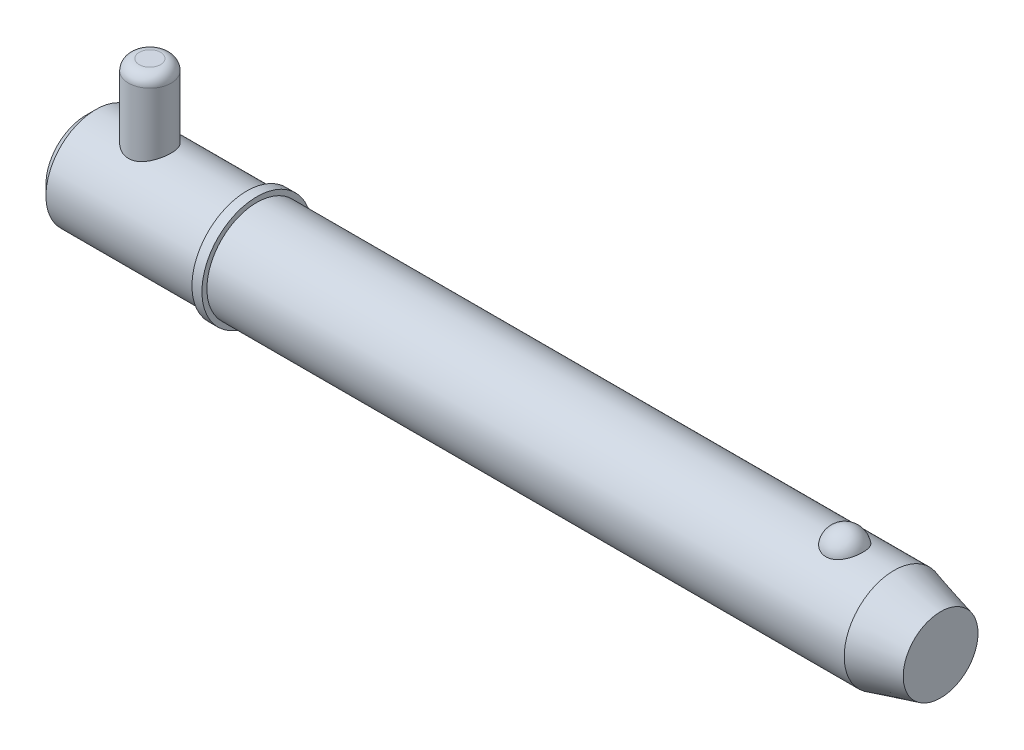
ISO-10303-21;
HEADER;
FILE_DESCRIPTION(('STEP AP214'),'2;1');
FILE_NAME('part.step','',(''),(''),'','','');
FILE_SCHEMA(('AUTOMOTIVE_DESIGN { 1 0 10303 214 1 1 1 1 }'));
ENDSEC;
DATA;
#1=APPLICATION_CONTEXT('core data for automotive mechanical design processes');
#2=APPLICATION_PROTOCOL_DEFINITION('international standard','automotive_design',2000,#1);
#3=PRODUCT_CONTEXT('',#1,'mechanical');
#4=PRODUCT('Part','Part','',(#3));
#5=PRODUCT_RELATED_PRODUCT_CATEGORY('part','',(#4));
#6=PRODUCT_DEFINITION_FORMATION('','',#4);
#7=PRODUCT_DEFINITION_CONTEXT('part definition',#1,'design');
#8=PRODUCT_DEFINITION('design','',#6,#7);
#9=PRODUCT_DEFINITION_SHAPE('','',#8);
#10=(LENGTH_UNIT() NAMED_UNIT(*) SI_UNIT(.MILLI.,.METRE.));
#11=(NAMED_UNIT(*) PLANE_ANGLE_UNIT() SI_UNIT($,.RADIAN.));
#12=(NAMED_UNIT(*) SI_UNIT($,.STERADIAN.) SOLID_ANGLE_UNIT());
#13=UNCERTAINTY_MEASURE_WITH_UNIT(LENGTH_MEASURE(1.E-05),#10,'distance_accuracy_value','');
#14=(GEOMETRIC_REPRESENTATION_CONTEXT(3) GLOBAL_UNCERTAINTY_ASSIGNED_CONTEXT((#13)) GLOBAL_UNIT_ASSIGNED_CONTEXT((#10,
#11,#12)) REPRESENTATION_CONTEXT('',''));
#15=CARTESIAN_POINT('',(0.,0.,0.));
#16=DIRECTION('',(0.,0.,1.));
#17=DIRECTION('',(1.,0.,0.));
#18=AXIS2_PLACEMENT_3D('',#15,#16,#17);
#19=CARTESIAN_POINT('',(14.28,26.985,0.));
#20=DIRECTION('',(0.,-1.,0.));
#21=DIRECTION('',(0.,0.,-1.));
#22=AXIS2_PLACEMENT_3D('',#19,#20,#21);
#23=CYLINDRICAL_SURFACE('',#22,4.76);
#24=CARTESIAN_POINT('',(14.28,-8.73500000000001,0.));
#25=DIRECTION('',(0.,1.,0.));
#26=DIRECTION('',(0.,0.,1.));
#27=AXIS2_PLACEMENT_3D('',#24,#25,#26);
#28=CIRCLE('',#27,4.76);
#29=CARTESIAN_POINT('',(14.28,-8.73500000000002,-4.76));
#30=VERTEX_POINT('',#29);
#31=EDGE_CURVE('P0_E25',#30,#30,#28,.T.);
#32=CARTESIAN_POINT('',(14.28,24.605,0.));
#33=DIRECTION('',(0.,1.,0.));
#34=DIRECTION('',(0.,0.,1.));
#35=AXIS2_PLACEMENT_3D('',#32,#33,#34);
#36=CIRCLE('',#35,4.76);
#37=CARTESIAN_POINT('',(14.28,24.605,-4.76));
#38=VERTEX_POINT('',#37);
#39=EDGE_CURVE('P0_E29',#38,#38,#36,.F.);
#40=CARTESIAN_POINT('',(14.28,-8.73500000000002,-4.76));
#41=CARTESIAN_POINT('',(14.28,-8.38770833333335,-4.76));
#42=CARTESIAN_POINT('',(14.28,-8.04041666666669,-4.76));
#43=CARTESIAN_POINT('',(14.28,-7.34583333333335,-4.76));
#44=CARTESIAN_POINT('',(14.28,-6.99854166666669,-4.76));
#45=CARTESIAN_POINT('',(14.28,-6.30395833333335,-4.76));
#46=CARTESIAN_POINT('',(14.28,-5.95666666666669,-4.76));
#47=CARTESIAN_POINT('',(14.28,-5.26208333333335,-4.76));
#48=CARTESIAN_POINT('',(14.28,-4.91479166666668,-4.76));
#49=CARTESIAN_POINT('',(14.28,-4.22020833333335,-4.76));
#50=CARTESIAN_POINT('',(14.28,-3.87291666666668,-4.76));
#51=CARTESIAN_POINT('',(14.28,-3.17833333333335,-4.76));
#52=CARTESIAN_POINT('',(14.28,-2.83104166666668,-4.76));
#53=CARTESIAN_POINT('',(14.28,-2.13645833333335,-4.76));
#54=CARTESIAN_POINT('',(14.28,-1.78916666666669,-4.76));
#55=CARTESIAN_POINT('',(14.28,-1.09458333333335,-4.76));
#56=CARTESIAN_POINT('',(14.28,-0.747291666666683,-4.76));
#57=CARTESIAN_POINT('',(14.28,-0.052708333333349,-4.76));
#58=CARTESIAN_POINT('',(14.28,0.294583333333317,-4.76));
#59=CARTESIAN_POINT('',(14.28,0.989166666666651,-4.76));
#60=CARTESIAN_POINT('',(14.28,1.33645833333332,-4.76));
#61=CARTESIAN_POINT('',(14.28,2.03104166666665,-4.76));
#62=CARTESIAN_POINT('',(14.28,2.37833333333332,-4.76));
#63=CARTESIAN_POINT('',(14.28,3.07291666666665,-4.76));
#64=CARTESIAN_POINT('',(14.28,3.42020833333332,-4.76));
#65=CARTESIAN_POINT('',(14.28,4.11479166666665,-4.76));
#66=CARTESIAN_POINT('',(14.28,4.46208333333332,-4.76));
#67=CARTESIAN_POINT('',(14.28,5.15666666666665,-4.76));
#68=CARTESIAN_POINT('',(14.28,5.50395833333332,-4.76));
#69=CARTESIAN_POINT('',(14.28,6.19854166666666,-4.76));
#70=CARTESIAN_POINT('',(14.28,6.54583333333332,-4.76));
#71=CARTESIAN_POINT('',(14.28,7.24041666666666,-4.76));
#72=CARTESIAN_POINT('',(14.28,7.58770833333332,-4.76));
#73=CARTESIAN_POINT('',(14.28,8.28229166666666,-4.76));
#74=CARTESIAN_POINT('',(14.28,8.62958333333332,-4.76));
#75=CARTESIAN_POINT('',(14.28,9.32416666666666,-4.76));
#76=CARTESIAN_POINT('',(14.28,9.67145833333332,-4.76));
#77=CARTESIAN_POINT('',(14.28,10.3660416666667,-4.76));
#78=CARTESIAN_POINT('',(14.28,10.7133333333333,-4.76));
#79=CARTESIAN_POINT('',(14.28,11.4079166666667,-4.76));
#80=CARTESIAN_POINT('',(14.28,11.7552083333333,-4.76));
#81=CARTESIAN_POINT('',(14.28,12.4497916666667,-4.76));
#82=CARTESIAN_POINT('',(14.28,12.7970833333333,-4.76));
#83=CARTESIAN_POINT('',(14.28,13.4916666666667,-4.76));
#84=CARTESIAN_POINT('',(14.28,13.8389583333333,-4.76));
#85=CARTESIAN_POINT('',(14.28,14.5335416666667,-4.76));
#86=CARTESIAN_POINT('',(14.28,14.8808333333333,-4.76));
#87=CARTESIAN_POINT('',(14.28,15.5754166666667,-4.76));
#88=CARTESIAN_POINT('',(14.28,15.9227083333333,-4.76));
#89=CARTESIAN_POINT('',(14.28,16.6172916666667,-4.76));
#90=CARTESIAN_POINT('',(14.28,16.9645833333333,-4.76));
#91=CARTESIAN_POINT('',(14.28,17.6591666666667,-4.76));
#92=CARTESIAN_POINT('',(14.28,18.0064583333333,-4.76));
#93=CARTESIAN_POINT('',(14.28,18.7010416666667,-4.76));
#94=CARTESIAN_POINT('',(14.28,19.0483333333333,-4.76));
#95=CARTESIAN_POINT('',(14.28,19.7429166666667,-4.76));
#96=CARTESIAN_POINT('',(14.28,20.0902083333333,-4.76));
#97=CARTESIAN_POINT('',(14.28,20.7847916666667,-4.76));
#98=CARTESIAN_POINT('',(14.28,21.1320833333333,-4.76));
#99=CARTESIAN_POINT('',(14.28,21.8266666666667,-4.76));
#100=CARTESIAN_POINT('',(14.28,22.1739583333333,-4.76));
#101=CARTESIAN_POINT('',(14.28,22.8685416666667,-4.76));
#102=CARTESIAN_POINT('',(14.28,23.2158333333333,-4.76));
#103=CARTESIAN_POINT('',(14.28,23.9104166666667,-4.76));
#104=CARTESIAN_POINT('',(14.28,24.2577083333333,-4.76));
#105=CARTESIAN_POINT('',(14.28,24.605,-4.76));
#106=B_SPLINE_CURVE_WITH_KNOTS('',3,(#40,#41,#42,#43,#44,#45,#46,#47,#48,#49,#50,#51,#52,#53,
#54,#55,#56,#57,#58,#59,#60,#61,#62,#63,#64,#65,#66,#67,#68,#69,#70,#71,#72,#73,#74,#75,#76,#77,
#78,#79,#80,#81,#82,#83,#84,#85,#86,#87,#88,#89,#90,#91,#92,#93,#94,#95,#96,#97,#98,#99,#100,
#101,#102,#103,#104,#105),.UNSPECIFIED.,.F.,.F.,(4,2,2,2,2,2,2,2,2,2,2,2,2,2,2,2,2,2,2,2,2,2,2,
2,2,2,2,2,2,2,2,2,4),(0.,1.041875,2.08375,3.125625,4.1675,5.209375,6.25125,7.293125,
8.33500000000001,9.376875,10.41875,11.460625,12.5025,13.544375,14.58625,15.628125,16.67,
17.711875,18.75375,19.795625,20.8375,21.879375,22.92125,23.963125,25.005,26.046875,27.08875,
28.130625,29.1725,30.214375,31.25625,32.298125,33.34),.UNSPECIFIED.);
#107=EDGE_CURVE('P0_BSEAM14',#30,#38,#106,.T.);
#108=ORIENTED_EDGE('',*,*,#31,.T.);
#109=ORIENTED_EDGE('',*,*,#39,.T.);
#110=ORIENTED_EDGE('',*,*,#107,.T.);
#111=ORIENTED_EDGE('',*,*,#107,.F.);
#112=EDGE_LOOP('',(#108,#110,#109,#111));
#113=FACE_BOUND('',#112,.T.);
#114=ADVANCED_FACE('P0_F14',(#113),#23,.T.);
#115=CARTESIAN_POINT('',(14.28,26.985,0.));
#116=DIRECTION('',(0.,1.,0.));
#117=DIRECTION('',(0.,0.,1.));
#118=AXIS2_PLACEMENT_3D('',#115,#116,#117);
#119=PLANE('',#118);
#120=CARTESIAN_POINT('',(14.28,26.985,0.));
#121=DIRECTION('',(0.,1.,0.));
#122=DIRECTION('',(0.,0.,1.));
#123=AXIS2_PLACEMENT_3D('',#120,#121,#122);
#124=CIRCLE('',#123,2.38);
#125=CARTESIAN_POINT('',(14.28,26.985,2.38));
#126=VERTEX_POINT('',#125);
#127=EDGE_CURVE('P0_E10',#126,#126,#124,.T.);
#128=ORIENTED_EDGE('',*,*,#127,.T.);
#129=EDGE_LOOP('',(#128));
#130=FACE_BOUND('',#129,.T.);
#131=ADVANCED_FACE('P0_F46',(#130),#119,.T.);
#132=CARTESIAN_POINT('',(14.28,-11.115,0.));
#133=DIRECTION('',(0.,1.,0.));
#134=DIRECTION('',(0.,0.,1.));
#135=AXIS2_PLACEMENT_3D('',#132,#133,#134);
#136=PLANE('',#135);
#137=CARTESIAN_POINT('',(14.28,-11.115,0.));
#138=DIRECTION('',(0.,1.,0.));
#139=DIRECTION('',(0.,0.,1.));
#140=AXIS2_PLACEMENT_3D('',#137,#138,#139);
#141=CIRCLE('',#140,2.38);
#142=CARTESIAN_POINT('',(14.28,-11.115,2.38));
#143=VERTEX_POINT('',#142);
#144=EDGE_CURVE('P0_E21',#143,#143,#141,.F.);
#145=ORIENTED_EDGE('',*,*,#144,.T.);
#146=EDGE_LOOP('',(#145));
#147=FACE_BOUND('',#146,.T.);
#148=ADVANCED_FACE('P0_F43',(#147),#136,.F.);
#149=CARTESIAN_POINT('',(14.28,-8.735,0.));
#150=DIRECTION('',(0.,1.,0.));
#151=DIRECTION('',(0.,0.,1.));
#152=AXIS2_PLACEMENT_3D('',#149,#150,#151);
#153=DEGENERATE_TOROIDAL_SURFACE('',#152,2.38,2.38,.T.);
#154=ORIENTED_EDGE('',*,*,#144,.F.);
#155=EDGE_LOOP('',(#154));
#156=FACE_BOUND('',#155,.T.);
#157=ORIENTED_EDGE('',*,*,#31,.F.);
#158=EDGE_LOOP('',(#157));
#159=FACE_BOUND('',#158,.T.);
#160=ADVANCED_FACE('P0_F38',(#156,#159),#153,.T.);
#161=CARTESIAN_POINT('',(14.28,24.605,0.));
#162=DIRECTION('',(0.,1.,0.));
#163=DIRECTION('',(0.,0.,1.));
#164=AXIS2_PLACEMENT_3D('',#161,#162,#163);
#165=DEGENERATE_TOROIDAL_SURFACE('',#164,2.38,2.38,.T.);
#166=ORIENTED_EDGE('',*,*,#39,.F.);
#167=EDGE_LOOP('',(#166));
#168=FACE_BOUND('',#167,.T.);
#169=ORIENTED_EDGE('',*,*,#127,.F.);
#170=EDGE_LOOP('',(#169));
#171=FACE_BOUND('',#170,.T.);
#172=ADVANCED_FACE('P0_F16',(#168,#171),#165,.T.);
#173=CLOSED_SHELL('',(#114,#131,#148,#160,#172));
#174=MANIFOLD_SOLID_BREP('P0_B1',#173);
#175=CARTESIAN_POINT('',(0.,0.,0.));
#176=DIRECTION('',(1.,0.,0.));
#177=DIRECTION('',(0.,0.,-1.));
#178=AXIS2_PLACEMENT_3D('',#175,#176,#177);
#179=CYLINDRICAL_SURFACE('',#178,11.115);
#180=CARTESIAN_POINT('',(180.129563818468,0.,0.));
#181=DIRECTION('',(1.,0.,0.));
#182=DIRECTION('',(0.,0.,-1.));
#183=AXIS2_PLACEMENT_3D('',#180,#181,#182);
#184=CIRCLE('',#183,11.115);
#185=CARTESIAN_POINT('',(180.129563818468,0.,-11.115));
#186=VERTEX_POINT('',#185);
#187=EDGE_CURVE('P1_E81',#186,#186,#184,.T.);
#188=ORIENTED_EDGE('',*,*,#187,.F.);
#189=EDGE_LOOP('',(#188));
#190=FACE_BOUND('',#189,.T.);
#191=CARTESIAN_POINT('',(38.1,0.,0.));
#192=DIRECTION('',(1.,0.,0.));
#193=DIRECTION('',(0.,0.,-1.));
#194=AXIS2_PLACEMENT_3D('',#191,#192,#193);
#195=CIRCLE('',#194,11.115);
#196=CARTESIAN_POINT('',(38.1,0.,-11.115));
#197=VERTEX_POINT('',#196);
#198=EDGE_CURVE('P1_E85',#197,#197,#195,.T.);
#199=ORIENTED_EDGE('',*,*,#198,.T.);
#200=EDGE_LOOP('',(#199));
#201=FACE_BOUND('',#200,.T.);
#202=CARTESIAN_POINT('',(169.131068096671,10.3028087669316,4.17077409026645));
#203=CARTESIAN_POINT('',(168.914775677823,10.3028003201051,4.17078240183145));
#204=CARTESIAN_POINT('',(168.698548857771,10.3098895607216,4.15340593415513));
#205=CARTESIAN_POINT('',(168.272540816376,10.3373834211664,4.08449540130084));
#206=CARTESIAN_POINT('',(168.062757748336,10.3577841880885,4.03297121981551));
#207=CARTESIAN_POINT('',(167.655782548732,10.4095237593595,3.89746513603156));
#208=CARTESIAN_POINT('',(167.458572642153,10.4408466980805,3.81353029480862));
#209=CARTESIAN_POINT('',(167.081338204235,10.5110236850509,3.61560339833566));
#210=CARTESIAN_POINT('',(166.901317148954,10.5498792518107,3.50160528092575));
#211=CARTESIAN_POINT('',(166.557684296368,10.6322884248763,3.24292464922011));
#212=CARTESIAN_POINT('',(166.394686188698,10.6759443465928,3.09746040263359));
#213=CARTESIAN_POINT('',(166.094591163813,10.7625291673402,2.7817192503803));
#214=CARTESIAN_POINT('',(165.957499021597,10.8054579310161,2.61143778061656));
#215=CARTESIAN_POINT('',(165.706408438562,10.8881935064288,2.24226695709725));
#216=CARTESIAN_POINT('',(165.593710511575,10.9277761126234,2.04244123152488));
#217=CARTESIAN_POINT('',(165.401777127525,10.997484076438,1.62578254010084));
#218=CARTESIAN_POINT('',(165.322544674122,11.0276085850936,1.40894804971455));
#219=CARTESIAN_POINT('',(165.198303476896,11.0756732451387,0.961250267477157));
#220=CARTESIAN_POINT('',(165.153760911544,11.0934470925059,0.73023943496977));
#221=CARTESIAN_POINT('',(165.101569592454,11.1143331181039,0.263439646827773));
#222=CARTESIAN_POINT('',(165.093920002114,11.1174456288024,0.0276507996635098));
#223=CARTESIAN_POINT('',(165.11561056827,11.1087161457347,-0.440729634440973));
#224=CARTESIAN_POINT('',(165.144762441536,11.0969502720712,-0.673331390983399));
#225=CARTESIAN_POINT('',(165.239143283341,11.0597872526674,-1.12996621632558));
#226=CARTESIAN_POINT('',(165.304372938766,11.0343898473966,-1.35399912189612));
#227=CARTESIAN_POINT('',(165.46969844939,10.972515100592,-1.78750286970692));
#228=CARTESIAN_POINT('',(165.56983863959,10.9360236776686,-1.99695478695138));
#229=CARTESIAN_POINT('',(165.802940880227,10.8557595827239,-2.39520667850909));
#230=CARTESIAN_POINT('',(165.935905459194,10.8119863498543,-2.58400506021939));
#231=CARTESIAN_POINT('',(166.232407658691,10.7216733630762,-2.93635726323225));
#232=CARTESIAN_POINT('',(166.396056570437,10.675123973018,-3.09981510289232));
#233=CARTESIAN_POINT('',(166.749860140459,10.5846571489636,-3.39592247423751));
#234=CARTESIAN_POINT('',(166.940012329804,10.5407394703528,-3.52857487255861));
#235=CARTESIAN_POINT('',(167.33750141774,10.4616690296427,-3.75646057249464));
#236=CARTESIAN_POINT('',(167.54436705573,10.4263443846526,-3.85245432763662));
#237=CARTESIAN_POINT('',(167.97295417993,10.3675574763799,-4.0079874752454));
#238=CARTESIAN_POINT('',(168.194670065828,10.344090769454,-4.06754052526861));
#239=CARTESIAN_POINT('',(168.634669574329,10.3128282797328,-4.14614314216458));
#240=CARTESIAN_POINT('',(168.852565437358,10.3043040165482,-4.1670783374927));
#241=CARTESIAN_POINT('',(169.28894951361,10.3016771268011,-4.17357158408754));
#242=CARTESIAN_POINT('',(169.507437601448,10.3075716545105,-4.15913661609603));
#243=CARTESIAN_POINT('',(169.931744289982,10.3326686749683,-4.09636961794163));
#244=CARTESIAN_POINT('',(170.137745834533,10.3514555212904,-4.0490957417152));
#245=CARTESIAN_POINT('',(170.538576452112,10.399818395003,-3.92320197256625));
#246=CARTESIAN_POINT('',(170.7334046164,10.4293952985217,-3.84457953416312));
#247=CARTESIAN_POINT('',(171.111191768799,10.4969600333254,-3.65612410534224));
#248=CARTESIAN_POINT('',(171.293797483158,10.5351178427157,-3.54564545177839));
#249=CARTESIAN_POINT('',(171.638204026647,10.6154999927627,-3.29718036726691));
#250=CARTESIAN_POINT('',(171.800000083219,10.657725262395,-3.15918764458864));
#251=CARTESIAN_POINT('',(172.106959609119,10.744212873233,-2.85163580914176));
#252=CARTESIAN_POINT('',(172.250891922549,10.7884718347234,-2.68084605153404));
#253=CARTESIAN_POINT('',(172.509237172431,10.872374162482,-2.31721864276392));
#254=CARTESIAN_POINT('',(172.623644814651,10.9120167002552,-2.12437704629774));
#255=CARTESIAN_POINT('',(172.823873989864,10.9838919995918,-1.71516999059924));
#256=CARTESIAN_POINT('',(172.90866178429,11.0158465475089,-1.49824866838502));
#257=CARTESIAN_POINT('',(173.04268382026,11.0673523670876,-1.05228572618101));
#258=CARTESIAN_POINT('',(173.091917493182,11.086903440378,-0.823243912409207));
#259=CARTESIAN_POINT('',(173.153891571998,11.1116323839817,-0.359087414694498));
#260=CARTESIAN_POINT('',(173.166566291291,11.1167843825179,-0.12396256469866));
#261=CARTESIAN_POINT('',(173.154973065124,11.1121144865,0.345220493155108));
#262=CARTESIAN_POINT('',(173.130705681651,11.1022928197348,0.579278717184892));
#263=CARTESIAN_POINT('',(173.045907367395,11.0687504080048,1.03866534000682));
#264=CARTESIAN_POINT('',(172.985529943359,11.0450885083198,1.26402641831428));
#265=CARTESIAN_POINT('',(172.829853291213,10.9863185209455,1.70076772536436));
#266=CARTESIAN_POINT('',(172.734551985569,10.9512097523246,1.91214712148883));
#267=CARTESIAN_POINT('',(172.510397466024,10.8729733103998,2.316083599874));
#268=CARTESIAN_POINT('',(172.381380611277,10.8298068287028,2.50854240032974));
#269=CARTESIAN_POINT('',(172.092732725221,10.7401896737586,2.86808766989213));
#270=CARTESIAN_POINT('',(171.933102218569,10.6937390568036,3.03517457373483));
#271=CARTESIAN_POINT('',(171.587534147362,10.6029321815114,3.33857581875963));
#272=CARTESIAN_POINT('',(171.401708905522,10.5585680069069,3.47501541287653));
#273=CARTESIAN_POINT('',(171.007875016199,10.4769321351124,3.71390897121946));
#274=CARTESIAN_POINT('',(170.799863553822,10.439661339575,3.81635861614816));
#275=CARTESIAN_POINT('',(170.354066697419,10.3749407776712,3.98910631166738));
#276=CARTESIAN_POINT('',(170.115234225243,10.3482457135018,4.05700929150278));
#277=CARTESIAN_POINT('',(169.627925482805,10.312188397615,4.14782844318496));
#278=CARTESIAN_POINT('',(169.379453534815,10.3028184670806,4.17076454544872));
#279=CARTESIAN_POINT('',(169.131068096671,10.3028087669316,4.17077409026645));
#280=B_SPLINE_CURVE_WITH_KNOTS('',3,(#202,#203,#204,#205,#206,#207,#208,#209,#210,#211,#212,
#213,#214,#215,#216,#217,#218,#219,#220,#221,#222,#223,#224,#225,#226,#227,#228,#229,#230,#231,
#232,#233,#234,#235,#236,#237,#238,#239,#240,#241,#242,#243,#244,#245,#246,#247,#248,#249,#250,
#251,#252,#253,#254,#255,#256,#257,#258,#259,#260,#261,#262,#263,#264,#265,#266,#267,#268,#269,
#270,#271,#272,#273,#274,#275,#276,#277,#278,#279),.UNSPECIFIED.,.T.,.F.,(4,2,2,2,2,2,2,2,2,2,2,
2,2,2,2,2,2,2,2,2,2,2,2,2,2,2,2,2,2,2,2,2,2,2,2,2,2,2,4),(0.,0.647966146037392,1.29574482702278,
1.9425864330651,2.58955857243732,3.25496465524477,3.92049326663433,4.61566368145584,
5.31089647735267,6.01531821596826,6.71972398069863,7.42054043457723,8.12137023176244,
8.82309331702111,9.5248704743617,10.2292439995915,10.9335519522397,11.6223330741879,
12.3108558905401,12.9647664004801,13.6185478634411,14.252184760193,14.8858731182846,
15.5334360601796,16.1811472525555,16.8611459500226,17.5412664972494,18.2431855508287,
18.9451158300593,19.6483065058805,20.3514864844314,21.0516982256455,21.7519516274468,
22.4556690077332,23.1593743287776,23.8601491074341,24.5610129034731,25.3054529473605,
26.049562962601),.UNSPECIFIED.);
#281=CARTESIAN_POINT('',(169.131068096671,10.3028087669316,4.17077409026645));
#282=VERTEX_POINT('',#281);
#283=EDGE_CURVE('P1_E35',#282,#282,#280,.T.);
#284=ORIENTED_EDGE('',*,*,#283,.T.);
#285=EDGE_LOOP('',(#284));
#286=FACE_BOUND('',#285,.T.);
#287=ADVANCED_FACE('P1_F13',(#190,#201,#286),#179,.T.);
#288=CARTESIAN_POINT('',(0.,0.,0.));
#289=DIRECTION('',(-1.,0.,0.));
#290=DIRECTION('',(0.,0.,1.));
#291=AXIS2_PLACEMENT_3D('',#288,#289,#290);
#292=PLANE('',#291);
#293=CARTESIAN_POINT('',(0.,0.,0.));
#294=DIRECTION('',(1.,0.,0.));
#295=DIRECTION('',(0.,0.,-1.));
#296=AXIS2_PLACEMENT_3D('',#293,#294,#295);
#297=CIRCLE('',#296,8.892);
#298=CARTESIAN_POINT('',(0.,0.,-8.892));
#299=VERTEX_POINT('',#298);
#300=EDGE_CURVE('P1_E9',#299,#299,#297,.T.);
#301=ORIENTED_EDGE('',*,*,#300,.F.);
#302=EDGE_LOOP('',(#301));
#303=FACE_BOUND('',#302,.T.);
#304=ADVANCED_FACE('P1_F15',(#303),#292,.T.);
#305=CARTESIAN_POINT('',(2.22299999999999,0.,0.));
#306=DIRECTION('',(1.,0.,0.));
#307=DIRECTION('',(0.,0.,-1.));
#308=AXIS2_PLACEMENT_3D('',#305,#306,#307);
#309=CONICAL_SURFACE('',#308,11.115,0.78539816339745);
#310=ORIENTED_EDGE('',*,*,#300,.T.);
#311=EDGE_LOOP('',(#310));
#312=FACE_BOUND('',#311,.T.);
#313=CARTESIAN_POINT('',(2.22299999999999,0.,0.));
#314=DIRECTION('',(1.,0.,0.));
#315=DIRECTION('',(0.,0.,-1.));
#316=AXIS2_PLACEMENT_3D('',#313,#314,#315);
#317=CIRCLE('',#316,11.115);
#318=CARTESIAN_POINT('',(2.22299999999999,0.,-11.115));
#319=VERTEX_POINT('',#318);
#320=EDGE_CURVE('P1_E26',#319,#319,#317,.T.);
#321=ORIENTED_EDGE('',*,*,#320,.F.);
#322=EDGE_LOOP('',(#321));
#323=FACE_BOUND('',#322,.T.);
#324=ADVANCED_FACE('P1_F77',(#312,#323),#309,.T.);
#325=CARTESIAN_POINT('',(0.,0.,0.));
#326=DIRECTION('',(1.,0.,0.));
#327=DIRECTION('',(0.,0.,-1.));
#328=AXIS2_PLACEMENT_3D('',#325,#326,#327);
#329=CYLINDRICAL_SURFACE('',#328,11.115);
#330=CARTESIAN_POINT('',(14.28,-10.0441836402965,4.76));
#331=CARTESIAN_POINT('',(14.1533731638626,-10.0441846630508,4.75999904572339));
#332=CARTESIAN_POINT('',(14.0267055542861,-10.0465865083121,4.75493985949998));
#333=CARTESIAN_POINT('',(13.774298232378,-10.0561141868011,4.73475585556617));
#334=CARTESIAN_POINT('',(13.6485591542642,-10.0632429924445,4.71962470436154));
#335=CARTESIAN_POINT('',(13.3987500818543,-10.0819979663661,4.67942666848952));
#336=CARTESIAN_POINT('',(13.2746840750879,-10.0936334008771,4.65433930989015));
#337=CARTESIAN_POINT('',(13.0293244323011,-10.1210146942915,4.59449317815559));
#338=CARTESIAN_POINT('',(12.9080319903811,-10.1367622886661,4.55973032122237));
#339=CARTESIAN_POINT('',(12.669614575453,-10.1717810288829,4.48106435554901));
#340=CARTESIAN_POINT('',(12.5524727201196,-10.1910352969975,4.4372048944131));
#341=CARTESIAN_POINT('',(12.3224300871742,-10.2325403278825,4.34063417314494));
#342=CARTESIAN_POINT('',(12.2095309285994,-10.2547922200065,4.28791957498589));
#343=CARTESIAN_POINT('',(11.8782785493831,-10.3250879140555,4.11715127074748));
#344=CARTESIAN_POINT('',(11.6670799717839,-10.3767168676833,3.98637638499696));
#345=CARTESIAN_POINT('',(11.2564039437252,-10.4874309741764,3.68567149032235));
#346=CARTESIAN_POINT('',(11.0583793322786,-10.5467772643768,3.51386978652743));
#347=CARTESIAN_POINT('',(10.6927724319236,-10.6641377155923,3.13969960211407));
#348=CARTESIAN_POINT('',(10.5252022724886,-10.7221513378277,2.93731900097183));
#349=CARTESIAN_POINT('',(10.2965609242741,-10.8050020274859,2.60935726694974));
#350=CARTESIAN_POINT('',(10.2227768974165,-10.8324811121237,2.49310321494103));
#351=CARTESIAN_POINT('',(10.0853380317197,-10.884703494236,2.25418999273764));
#352=CARTESIAN_POINT('',(10.0216789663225,-10.9094479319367,2.13153352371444));
#353=CARTESIAN_POINT('',(9.90506238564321,-10.9554932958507,1.88060370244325));
#354=CARTESIAN_POINT('',(9.85210574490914,-10.9767939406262,1.7523298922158));
#355=CARTESIAN_POINT('',(9.75746464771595,-11.0153112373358,1.49115740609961));
#356=CARTESIAN_POINT('',(9.71577447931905,-11.0325299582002,1.35826111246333));
#357=CARTESIAN_POINT('',(9.64605475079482,-11.0615607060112,1.09614539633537));
#358=CARTESIAN_POINT('',(9.61740732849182,-11.0736151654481,0.96711700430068));
#359=CARTESIAN_POINT('',(9.57092026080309,-11.0932687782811,0.706847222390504));
#360=CARTESIAN_POINT('',(9.55307574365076,-11.1008699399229,0.575606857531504));
#361=CARTESIAN_POINT('',(9.52838640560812,-11.1114054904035,0.31192917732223));
#362=CARTESIAN_POINT('',(9.52153986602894,-11.114340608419,0.179492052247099));
#363=CARTESIAN_POINT('',(9.51892405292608,-11.1154607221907,-0.0855090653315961));
#364=CARTESIAN_POINT('',(9.52315432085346,-11.1136459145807,-0.218073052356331));
#365=CARTESIAN_POINT('',(9.542009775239,-11.1055891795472,-0.473709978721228));
#366=CARTESIAN_POINT('',(9.55594693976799,-11.099640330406,-0.596843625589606));
#367=CARTESIAN_POINT('',(9.59332832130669,-11.0837823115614,-0.841440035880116));
#368=CARTESIAN_POINT('',(9.61677567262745,-11.0738718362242,-0.962902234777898));
#369=CARTESIAN_POINT('',(9.67294089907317,-11.0503378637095,-1.20325684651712));
#370=CARTESIAN_POINT('',(9.70565569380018,-11.0367156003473,-1.32215009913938));
#371=CARTESIAN_POINT('',(9.78005008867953,-11.0060908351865,-1.55666640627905));
#372=CARTESIAN_POINT('',(9.82173311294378,-10.9890870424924,-1.67228819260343));
#373=CARTESIAN_POINT('',(9.96110379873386,-10.9330280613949,-2.01656166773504));
#374=CARTESIAN_POINT('',(10.0722987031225,-10.8892801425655,-2.23915547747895));
#375=CARTESIAN_POINT('',(10.3268588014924,-10.7934745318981,-2.66299199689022));
#376=CARTESIAN_POINT('',(10.4702355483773,-10.7414138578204,-2.86422700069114));
#377=CARTESIAN_POINT('',(10.7973904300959,-10.6296201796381,-3.25557775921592));
#378=CARTESIAN_POINT('',(10.9833705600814,-10.569604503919,-3.443774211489));
#379=CARTESIAN_POINT('',(11.3844486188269,-10.4514707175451,-3.78722133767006));
#380=CARTESIAN_POINT('',(11.5995590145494,-10.3933534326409,-3.94245783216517));
#381=CARTESIAN_POINT('',(11.9444340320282,-10.311516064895,-4.14990014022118));
#382=CARTESIAN_POINT('',(12.0654579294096,-10.2847012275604,-4.21573894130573));
#383=CARTESIAN_POINT('',(12.3132718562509,-10.2342051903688,-4.33688518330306));
#384=CARTESIAN_POINT('',(12.4400593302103,-10.2105226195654,-4.39219723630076));
#385=CARTESIAN_POINT('',(12.6985418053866,-10.1671237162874,-4.49174500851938));
#386=CARTESIAN_POINT('',(12.8302359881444,-10.1474067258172,-4.53598256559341));
#387=CARTESIAN_POINT('',(13.0975061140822,-10.1126841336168,-4.61287629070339));
#388=CARTESIAN_POINT('',(13.233079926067,-10.0976759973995,-4.64553869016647));
#389=CARTESIAN_POINT('',(13.4978553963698,-10.0737863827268,-4.6971059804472));
#390=CARTESIAN_POINT('',(13.6268754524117,-10.0645618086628,-4.716785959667));
#391=CARTESIAN_POINT('',(13.8862990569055,-10.051062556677,-4.74548419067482));
#392=CARTESIAN_POINT('',(14.0167019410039,-10.0467856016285,-4.75450734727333));
#393=CARTESIAN_POINT('',(14.277859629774,-10.0433352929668,-4.76179143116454));
#394=CARTESIAN_POINT('',(14.4086143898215,-10.0441613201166,-4.76005366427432));
#395=CARTESIAN_POINT('',(14.6694025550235,-10.0508838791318,-4.74584231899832));
#396=CARTESIAN_POINT('',(14.7994359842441,-10.0567802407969,-4.73336910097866));
#397=CARTESIAN_POINT('',(15.0487369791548,-10.0728449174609,-4.69907984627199));
#398=CARTESIAN_POINT('',(15.1681238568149,-10.0826872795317,-4.67797462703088));
#399=CARTESIAN_POINT('',(15.4045894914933,-10.1062580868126,-4.62682977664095));
#400=CARTESIAN_POINT('',(15.5216674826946,-10.1199877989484,-4.59678723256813));
#401=CARTESIAN_POINT('',(15.868278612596,-10.1664161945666,-4.49365911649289));
#402=CARTESIAN_POINT('',(16.0933756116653,-10.2043671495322,-4.40754694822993));
#403=CARTESIAN_POINT('',(16.5357981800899,-10.2919879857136,-4.19898201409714));
#404=CARTESIAN_POINT('',(16.7523611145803,-10.3420954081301,-4.07511281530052));
#405=CARTESIAN_POINT('',(17.1627188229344,-10.4477911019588,-3.7959429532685));
#406=CARTESIAN_POINT('',(17.3565033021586,-10.5033818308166,-3.64062816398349));
#407=CARTESIAN_POINT('',(17.7334034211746,-10.6196376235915,-3.28693729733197));
#408=CARTESIAN_POINT('',(17.9141276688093,-10.6803237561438,-3.08599175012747));
#409=CARTESIAN_POINT('',(18.1582189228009,-10.7666348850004,-2.76320365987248));
#410=CARTESIAN_POINT('',(18.2351223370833,-10.7946346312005,-2.65197124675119));
#411=CARTESIAN_POINT('',(18.3793967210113,-10.8483267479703,-2.42297927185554));
#412=CARTESIAN_POINT('',(18.4467718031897,-10.87402011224,-2.30522255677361));
#413=CARTESIAN_POINT('',(18.5717669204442,-10.9225249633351,-2.06324665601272));
#414=CARTESIAN_POINT('',(18.6293326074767,-10.9453202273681,-1.93899615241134));
#415=CARTESIAN_POINT('',(18.73370006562,-10.9872100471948,-1.6855059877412));
#416=CARTESIAN_POINT('',(18.7805065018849,-11.0063062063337,-1.55626851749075));
#417=CARTESIAN_POINT('',(18.8628731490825,-11.0402419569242,-1.29375150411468));
#418=CARTESIAN_POINT('',(18.8984366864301,-11.0550828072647,-1.16047316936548));
#419=CARTESIAN_POINT('',(18.9579183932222,-11.0800638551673,-0.890912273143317));
#420=CARTESIAN_POINT('',(18.9818374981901,-11.0902044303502,-0.75462995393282));
#421=CARTESIAN_POINT('',(19.0164177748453,-11.104911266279,-0.490295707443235));
#422=CARTESIAN_POINT('',(19.027922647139,-11.1098318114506,-0.362373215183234));
#423=CARTESIAN_POINT('',(19.040554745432,-11.1152360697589,-0.105876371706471));
#424=CARTESIAN_POINT('',(19.0416784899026,-11.1157182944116,0.0226981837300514));
#425=CARTESIAN_POINT('',(19.0335275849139,-11.1122291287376,0.27938352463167));
#426=CARTESIAN_POINT('',(19.0242587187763,-11.1082602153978,0.407494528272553));
#427=CARTESIAN_POINT('',(18.9954320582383,-11.0959792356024,0.662388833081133));
#428=CARTESIAN_POINT('',(18.9758704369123,-11.0876655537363,0.789171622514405));
#429=CARTESIAN_POINT('',(18.9276379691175,-11.0673259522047,1.03545890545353));
#430=CARTESIAN_POINT('',(18.8993573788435,-11.0554596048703,1.15505309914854));
#431=CARTESIAN_POINT('',(18.8337694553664,-11.0282166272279,1.39134516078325));
#432=CARTESIAN_POINT('',(18.7964589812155,-11.0128387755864,1.5080420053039));
#433=CARTESIAN_POINT('',(18.671464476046,-10.9619666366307,1.85262797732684));
#434=CARTESIAN_POINT('',(18.5706772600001,-10.9217161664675,2.07521484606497));
#435=CARTESIAN_POINT('',(18.33202463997,-10.8301378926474,2.51061719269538));
#436=CARTESIAN_POINT('',(18.1926775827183,-10.7783885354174,2.72252375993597));
#437=CARTESIAN_POINT('',(17.8829747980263,-10.669863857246,3.12088015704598));
#438=CARTESIAN_POINT('',(17.7126068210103,-10.6130865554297,3.30731987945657));
#439=CARTESIAN_POINT('',(17.3310036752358,-10.495668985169,3.66358491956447));
#440=CARTESIAN_POINT('',(17.1177010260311,-10.4350471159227,3.83122543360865));
#441=CARTESIAN_POINT('',(16.7778915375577,-10.3495418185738,4.05420569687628));
#442=CARTESIAN_POINT('',(16.6612023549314,-10.3219229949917,4.12383380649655));
#443=CARTESIAN_POINT('',(16.4218466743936,-10.2693487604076,4.25306463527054));
#444=CARTESIAN_POINT('',(16.2991829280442,-10.2443921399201,4.31267191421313));
#445=CARTESIAN_POINT('',(16.0488008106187,-10.1979981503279,4.42126071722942));
#446=CARTESIAN_POINT('',(15.9210894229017,-10.1765561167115,4.47025635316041));
#447=CARTESIAN_POINT('',(15.6613937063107,-10.1379191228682,4.55720152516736));
#448=CARTESIAN_POINT('',(15.5294115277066,-10.1207220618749,4.59515652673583));
#449=CARTESIAN_POINT('',(15.2624981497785,-10.091252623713,4.65951684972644));
#450=CARTESIAN_POINT('',(15.1275757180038,-10.0789672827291,4.68595259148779));
#451=CARTESIAN_POINT('',(14.8556442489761,-10.0597530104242,4.72706206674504));
#452=CARTESIAN_POINT('',(14.7186368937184,-10.0528199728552,4.74174481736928));
#453=CARTESIAN_POINT('',(14.5310955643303,-10.047196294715,4.75363843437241));
#454=CARTESIAN_POINT('',(14.48091543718,-10.0460674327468,4.75602323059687));
#455=CARTESIAN_POINT('',(14.3804923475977,-10.044560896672,4.7592042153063));
#456=CARTESIAN_POINT('',(14.3302493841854,-10.0441832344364,4.76000037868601));
#457=CARTESIAN_POINT('',(14.28,-10.0441836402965,4.76));
#458=B_SPLINE_CURVE_WITH_KNOTS('',3,(#330,#331,#332,#333,#334,#335,#336,#337,#338,#339,#340,
#341,#342,#343,#344,#345,#346,#347,#348,#349,#350,#351,#352,#353,#354,#355,#356,#357,#358,#359,
#360,#361,#362,#363,#364,#365,#366,#367,#368,#369,#370,#371,#372,#373,#374,#375,#376,#377,#378,
#379,#380,#381,#382,#383,#384,#385,#386,#387,#388,#389,#390,#391,#392,#393,#394,#395,#396,#397,
#398,#399,#400,#401,#402,#403,#404,#405,#406,#407,#408,#409,#410,#411,#412,#413,#414,#415,#416,
#417,#418,#419,#420,#421,#422,#423,#424,#425,#426,#427,#428,#429,#430,#431,#432,#433,#434,#435,
#436,#437,#438,#439,#440,#441,#442,#443,#444,#445,#446,#447,#448,#449,#450,#451,#452,#453,#454,
#455,#456,#457),.UNSPECIFIED.,.T.,.F.,(4,2,2,2,2,2,2,2,2,2,2,2,2,2,2,2,2,2,2,2,2,2,2,2,2,2,2,2,
2,2,2,2,2,2,2,2,2,2,2,2,2,2,2,2,2,2,2,2,2,2,2,2,2,2,2,2,2,2,2,2,2,2,2,4),(0.,0.379828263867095,
0.759895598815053,1.14074858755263,1.52176256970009,1.90098898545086,2.28035867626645,
3.03818035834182,3.84125131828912,4.6446414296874,5.06541657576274,5.48601561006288,
5.90664899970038,6.3270687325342,6.72470503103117,7.12216187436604,7.51955659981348,
7.91693487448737,8.28868404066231,8.66055582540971,9.03230414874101,9.40419465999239,
10.1585834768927,10.9132435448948,11.7236471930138,12.5343987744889,12.9550196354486,
13.3754557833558,13.7958221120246,14.2159617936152,14.6079540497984,14.9997658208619,
15.3915300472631,15.7832811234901,16.1477615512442,16.512360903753,17.240999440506,
18.0012974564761,18.761937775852,19.5886929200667,20.0025782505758,20.4162843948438,
20.832212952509,21.2479608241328,21.6635855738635,22.0791769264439,22.4642880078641,
22.8495282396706,23.2345541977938,23.6197234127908,23.9896813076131,24.3597680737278,
25.099327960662,25.8726239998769,26.6462260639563,27.4759193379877,27.8914891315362,
28.3068693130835,28.7216936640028,29.1363123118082,29.5498292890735,29.9630287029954,
30.113753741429,30.2644811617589),.UNSPECIFIED.);
#459=CARTESIAN_POINT('',(14.28,-10.0441836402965,4.76));
#460=VERTEX_POINT('',#459);
#461=EDGE_CURVE('P1_E17',#460,#460,#458,.T.);
#462=ORIENTED_EDGE('',*,*,#461,.F.);
#463=EDGE_LOOP('',(#462));
#464=FACE_BOUND('',#463,.T.);
#465=CARTESIAN_POINT('',(14.28,10.0441836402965,4.76));
#466=CARTESIAN_POINT('',(14.4066268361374,10.0441846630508,4.75999904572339));
#467=CARTESIAN_POINT('',(14.5332944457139,10.0465865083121,4.75493985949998));
#468=CARTESIAN_POINT('',(14.785701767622,10.0561141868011,4.73475585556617));
#469=CARTESIAN_POINT('',(14.9114408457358,10.0632429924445,4.71962470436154));
#470=CARTESIAN_POINT('',(15.1612499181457,10.0819979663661,4.67942666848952));
#471=CARTESIAN_POINT('',(15.2853159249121,10.0936334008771,4.65433930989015));
#472=CARTESIAN_POINT('',(15.5306755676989,10.1210146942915,4.59449317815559));
#473=CARTESIAN_POINT('',(15.6519680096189,10.1367622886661,4.55973032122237));
#474=CARTESIAN_POINT('',(15.890385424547,10.1717810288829,4.48106435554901));
#475=CARTESIAN_POINT('',(16.0075272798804,10.1910352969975,4.4372048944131));
#476=CARTESIAN_POINT('',(16.2375699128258,10.2325403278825,4.34063417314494));
#477=CARTESIAN_POINT('',(16.3504690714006,10.2547922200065,4.28791957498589));
#478=CARTESIAN_POINT('',(16.6817214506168,10.3250879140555,4.11715127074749));
#479=CARTESIAN_POINT('',(16.8929200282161,10.3767168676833,3.98637638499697));
#480=CARTESIAN_POINT('',(17.3035960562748,10.4874309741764,3.68567149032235));
#481=CARTESIAN_POINT('',(17.5016206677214,10.5467772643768,3.51386978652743));
#482=CARTESIAN_POINT('',(17.8672275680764,10.6641377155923,3.13969960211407));
#483=CARTESIAN_POINT('',(18.0347977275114,10.7221513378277,2.93731900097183));
#484=CARTESIAN_POINT('',(18.2634390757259,10.8050020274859,2.60935726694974));
#485=CARTESIAN_POINT('',(18.3372231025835,10.8324811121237,2.49310321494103));
#486=CARTESIAN_POINT('',(18.4746619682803,10.884703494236,2.25418999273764));
#487=CARTESIAN_POINT('',(18.5383210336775,10.9094479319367,2.13153352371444));
#488=CARTESIAN_POINT('',(18.6549376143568,10.9554932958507,1.88060370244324));
#489=CARTESIAN_POINT('',(18.7078942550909,10.9767939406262,1.75232989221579));
#490=CARTESIAN_POINT('',(18.8025353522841,11.0153112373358,1.4911574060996));
#491=CARTESIAN_POINT('',(18.844225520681,11.0325299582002,1.35826111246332));
#492=CARTESIAN_POINT('',(18.9139452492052,11.0615607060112,1.09614539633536));
#493=CARTESIAN_POINT('',(18.9425926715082,11.0736151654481,0.967117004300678));
#494=CARTESIAN_POINT('',(18.9890797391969,11.0932687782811,0.706847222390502));
#495=CARTESIAN_POINT('',(19.0069242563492,11.1008699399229,0.575606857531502));
#496=CARTESIAN_POINT('',(19.0316135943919,11.1114054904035,0.311929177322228));
#497=CARTESIAN_POINT('',(19.0384601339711,11.114340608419,0.179492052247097));
#498=CARTESIAN_POINT('',(19.0410759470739,11.1154607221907,-0.0855090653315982));
#499=CARTESIAN_POINT('',(19.0368456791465,11.1136459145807,-0.218073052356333));
#500=CARTESIAN_POINT('',(19.017990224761,11.1055891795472,-0.47370997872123));
#501=CARTESIAN_POINT('',(19.004053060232,11.099640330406,-0.596843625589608));
#502=CARTESIAN_POINT('',(18.9666716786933,11.0837823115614,-0.841440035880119));
#503=CARTESIAN_POINT('',(18.9432243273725,11.0738718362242,-0.9629022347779));
#504=CARTESIAN_POINT('',(18.8870591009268,11.0503378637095,-1.20325684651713));
#505=CARTESIAN_POINT('',(18.8543443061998,11.0367156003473,-1.32215009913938));
#506=CARTESIAN_POINT('',(18.7799499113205,11.0060908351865,-1.55666640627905));
#507=CARTESIAN_POINT('',(18.7382668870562,10.9890870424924,-1.67228819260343));
#508=CARTESIAN_POINT('',(18.5988962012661,10.9330280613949,-2.01656166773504));
#509=CARTESIAN_POINT('',(18.4877012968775,10.8892801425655,-2.23915547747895));
#510=CARTESIAN_POINT('',(18.2331411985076,10.7934745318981,-2.66299199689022));
#511=CARTESIAN_POINT('',(18.0897644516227,10.7414138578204,-2.86422700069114));
#512=CARTESIAN_POINT('',(17.7626095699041,10.6296201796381,-3.25557775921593));
#513=CARTESIAN_POINT('',(17.5766294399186,10.569604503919,-3.443774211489));
#514=CARTESIAN_POINT('',(17.1755513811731,10.4514707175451,-3.78722133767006));
#515=CARTESIAN_POINT('',(16.9604409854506,10.3933534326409,-3.94245783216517));
#516=CARTESIAN_POINT('',(16.6155659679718,10.311516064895,-4.14990014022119));
#517=CARTESIAN_POINT('',(16.4945420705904,10.2847012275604,-4.21573894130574));
#518=CARTESIAN_POINT('',(16.2467281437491,10.2342051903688,-4.33688518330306));
#519=CARTESIAN_POINT('',(16.1199406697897,10.2105226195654,-4.39219723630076));
#520=CARTESIAN_POINT('',(15.8614581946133,10.1671237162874,-4.49174500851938));
#521=CARTESIAN_POINT('',(15.7297640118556,10.1474067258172,-4.53598256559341));
#522=CARTESIAN_POINT('',(15.4624938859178,10.1126841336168,-4.61287629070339));
#523=CARTESIAN_POINT('',(15.326920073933,10.0976759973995,-4.64553869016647));
#524=CARTESIAN_POINT('',(15.0621446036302,10.0737863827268,-4.6971059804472));
#525=CARTESIAN_POINT('',(14.9331245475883,10.0645618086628,-4.716785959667));
#526=CARTESIAN_POINT('',(14.6737009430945,10.051062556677,-4.74548419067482));
#527=CARTESIAN_POINT('',(14.543298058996,10.0467856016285,-4.75450734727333));
#528=CARTESIAN_POINT('',(14.2821403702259,10.0433352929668,-4.76179143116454));
#529=CARTESIAN_POINT('',(14.1513856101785,10.0441613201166,-4.76005366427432));
#530=CARTESIAN_POINT('',(13.8905974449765,10.0508838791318,-4.74584231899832));
#531=CARTESIAN_POINT('',(13.7605640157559,10.0567802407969,-4.73336910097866));
#532=CARTESIAN_POINT('',(13.5112630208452,10.0728449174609,-4.69907984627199));
#533=CARTESIAN_POINT('',(13.3918761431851,10.0826872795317,-4.67797462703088));
#534=CARTESIAN_POINT('',(13.1554105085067,10.1062580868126,-4.62682977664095));
#535=CARTESIAN_POINT('',(13.0383325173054,10.1199877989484,-4.59678723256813));
#536=CARTESIAN_POINT('',(12.691721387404,10.1664161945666,-4.49365911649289));
#537=CARTESIAN_POINT('',(12.4666243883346,10.2043671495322,-4.40754694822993));
#538=CARTESIAN_POINT('',(12.0242018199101,10.2919879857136,-4.19898201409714));
#539=CARTESIAN_POINT('',(11.8076388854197,10.3420954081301,-4.07511281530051));
#540=CARTESIAN_POINT('',(11.3972811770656,10.4477911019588,-3.7959429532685));
#541=CARTESIAN_POINT('',(11.2034966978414,10.5033818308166,-3.64062816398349));
#542=CARTESIAN_POINT('',(10.8265965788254,10.6196376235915,-3.28693729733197));
#543=CARTESIAN_POINT('',(10.6458723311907,10.6803237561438,-3.08599175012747));
#544=CARTESIAN_POINT('',(10.4017810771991,10.7666348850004,-2.76320365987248));
#545=CARTESIAN_POINT('',(10.3248776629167,10.7946346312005,-2.65197124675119));
#546=CARTESIAN_POINT('',(10.1806032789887,10.8483267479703,-2.42297927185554));
#547=CARTESIAN_POINT('',(10.1132281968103,10.87402011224,-2.30522255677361));
#548=CARTESIAN_POINT('',(9.98823307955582,10.9225249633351,-2.06324665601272));
#549=CARTESIAN_POINT('',(9.93066739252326,10.9453202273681,-1.93899615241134));
#550=CARTESIAN_POINT('',(9.82629993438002,10.9872100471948,-1.6855059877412));
#551=CARTESIAN_POINT('',(9.77949349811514,11.0063062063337,-1.55626851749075));
#552=CARTESIAN_POINT('',(9.69712685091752,11.0402419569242,-1.29375150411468));
#553=CARTESIAN_POINT('',(9.66156331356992,11.0550828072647,-1.16047316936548));
#554=CARTESIAN_POINT('',(9.60208160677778,11.0800638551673,-0.890912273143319));
#555=CARTESIAN_POINT('',(9.57816250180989,11.0902044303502,-0.754629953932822));
#556=CARTESIAN_POINT('',(9.54358222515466,11.104911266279,-0.490295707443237));
#557=CARTESIAN_POINT('',(9.53207735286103,11.1098318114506,-0.362373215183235));
#558=CARTESIAN_POINT('',(9.51944525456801,11.1152360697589,-0.105876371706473));
#559=CARTESIAN_POINT('',(9.51832151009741,11.1157182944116,0.0226981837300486));
#560=CARTESIAN_POINT('',(9.52647241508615,11.1122291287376,0.279383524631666));
#561=CARTESIAN_POINT('',(9.53574128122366,11.1082602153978,0.407494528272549));
#562=CARTESIAN_POINT('',(9.5645679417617,11.0959792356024,0.662388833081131));
#563=CARTESIAN_POINT('',(9.58412956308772,11.0876655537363,0.789171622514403));
#564=CARTESIAN_POINT('',(9.63236203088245,11.0673259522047,1.03545890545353));
#565=CARTESIAN_POINT('',(9.66064262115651,11.0554596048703,1.15505309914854));
#566=CARTESIAN_POINT('',(9.72623054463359,11.0282166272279,1.39134516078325));
#567=CARTESIAN_POINT('',(9.76354101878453,11.0128387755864,1.5080420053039));
#568=CARTESIAN_POINT('',(9.88853552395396,10.9619666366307,1.85262797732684));
#569=CARTESIAN_POINT('',(9.98932273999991,10.9217161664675,2.07521484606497));
#570=CARTESIAN_POINT('',(10.22797536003,10.8301378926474,2.51061719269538));
#571=CARTESIAN_POINT('',(10.3673224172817,10.7783885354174,2.72252375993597));
#572=CARTESIAN_POINT('',(10.6770252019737,10.669863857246,3.12088015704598));
#573=CARTESIAN_POINT('',(10.8473931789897,10.6130865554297,3.30731987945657));
#574=CARTESIAN_POINT('',(11.2289963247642,10.495668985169,3.66358491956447));
#575=CARTESIAN_POINT('',(11.4422989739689,10.4350471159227,3.83122543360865));
#576=CARTESIAN_POINT('',(11.7821084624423,10.3495418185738,4.05420569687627));
#577=CARTESIAN_POINT('',(11.8987976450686,10.3219229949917,4.12383380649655));
#578=CARTESIAN_POINT('',(12.1381533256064,10.2693487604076,4.25306463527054));
#579=CARTESIAN_POINT('',(12.2608170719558,10.2443921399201,4.31267191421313));
#580=CARTESIAN_POINT('',(12.5111991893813,10.1979981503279,4.42126071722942));
#581=CARTESIAN_POINT('',(12.6389105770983,10.1765561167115,4.47025635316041));
#582=CARTESIAN_POINT('',(12.8986062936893,10.1379191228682,4.55720152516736));
#583=CARTESIAN_POINT('',(13.0305884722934,10.1207220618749,4.59515652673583));
#584=CARTESIAN_POINT('',(13.2975018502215,10.091252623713,4.65951684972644));
#585=CARTESIAN_POINT('',(13.4324242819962,10.0789672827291,4.68595259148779));
#586=CARTESIAN_POINT('',(13.7043557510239,10.0597530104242,4.72706206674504));
#587=CARTESIAN_POINT('',(13.8413631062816,10.0528199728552,4.74174481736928));
#588=CARTESIAN_POINT('',(14.0289044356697,10.047196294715,4.75363843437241));
#589=CARTESIAN_POINT('',(14.07908456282,10.0460674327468,4.75602323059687));
#590=CARTESIAN_POINT('',(14.1795076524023,10.044560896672,4.7592042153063));
#591=CARTESIAN_POINT('',(14.2297506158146,10.0441832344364,4.76000037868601));
#592=CARTESIAN_POINT('',(14.28,10.0441836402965,4.76));
#593=B_SPLINE_CURVE_WITH_KNOTS('',3,(#465,#466,#467,#468,#469,#470,#471,#472,#473,#474,#475,
#476,#477,#478,#479,#480,#481,#482,#483,#484,#485,#486,#487,#488,#489,#490,#491,#492,#493,#494,
#495,#496,#497,#498,#499,#500,#501,#502,#503,#504,#505,#506,#507,#508,#509,#510,#511,#512,#513,
#514,#515,#516,#517,#518,#519,#520,#521,#522,#523,#524,#525,#526,#527,#528,#529,#530,#531,#532,
#533,#534,#535,#536,#537,#538,#539,#540,#541,#542,#543,#544,#545,#546,#547,#548,#549,#550,#551,
#552,#553,#554,#555,#556,#557,#558,#559,#560,#561,#562,#563,#564,#565,#566,#567,#568,#569,#570,
#571,#572,#573,#574,#575,#576,#577,#578,#579,#580,#581,#582,#583,#584,#585,#586,#587,#588,#589,
#590,#591,#592),.UNSPECIFIED.,.T.,.F.,(4,2,2,2,2,2,2,2,2,2,2,2,2,2,2,2,2,2,2,2,2,2,2,2,2,2,2,2,
2,2,2,2,2,2,2,2,2,2,2,2,2,2,2,2,2,2,2,2,2,2,2,2,2,2,2,2,2,2,2,2,2,2,2,4),(0.,0.379828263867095,
0.759895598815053,1.14074858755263,1.52176256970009,1.90098898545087,2.28035867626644,
3.03818035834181,3.84125131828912,4.6446414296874,5.06541657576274,5.48601561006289,
5.90664899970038,6.3270687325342,6.72470503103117,7.12216187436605,7.51955659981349,
7.91693487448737,8.28868404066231,8.66055582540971,9.03230414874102,9.4041946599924,
10.1585834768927,10.9132435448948,11.7236471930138,12.5343987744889,12.9550196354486,
13.3754557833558,13.7958221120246,14.2159617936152,14.6079540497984,14.9997658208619,
15.3915300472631,15.7832811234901,16.1477615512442,16.512360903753,17.240999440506,
18.0012974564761,18.761937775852,19.5886929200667,20.0025782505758,20.4162843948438,
20.832212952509,21.2479608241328,21.6635855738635,22.0791769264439,22.4642880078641,
22.8495282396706,23.2345541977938,23.6197234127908,23.9896813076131,24.3597680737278,
25.099327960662,25.8726239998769,26.6462260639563,27.4759193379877,27.8914891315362,
28.3068693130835,28.7216936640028,29.1363123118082,29.5498292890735,29.9630287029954,
30.113753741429,30.2644811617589),.UNSPECIFIED.);
#594=CARTESIAN_POINT('',(14.28,10.0441836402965,4.76));
#595=VERTEX_POINT('',#594);
#596=EDGE_CURVE('P1_E43',#595,#595,#593,.T.);
#597=ORIENTED_EDGE('',*,*,#596,.F.);
#598=EDGE_LOOP('',(#597));
#599=FACE_BOUND('',#598,.T.);
#600=ORIENTED_EDGE('',*,*,#320,.T.);
#601=EDGE_LOOP('',(#600));
#602=FACE_BOUND('',#601,.T.);
#603=CARTESIAN_POINT('',(35.877,0.,0.));
#604=DIRECTION('',(1.,0.,0.));
#605=DIRECTION('',(0.,0.,-1.));
#606=AXIS2_PLACEMENT_3D('',#603,#604,#605);
#607=CIRCLE('',#606,11.115);
#608=CARTESIAN_POINT('',(35.877,0.,-11.115));
#609=VERTEX_POINT('',#608);
#610=EDGE_CURVE('P1_E31',#609,#609,#607,.T.);
#611=ORIENTED_EDGE('',*,*,#610,.F.);
#612=EDGE_LOOP('',(#611));
#613=FACE_BOUND('',#612,.T.);
#614=ADVANCED_FACE('P1_F103',(#464,#599,#602,#613),#329,.T.);
#615=CARTESIAN_POINT('',(35.877,11.115,0.));
#616=DIRECTION('',(-1.,0.,0.));
#617=DIRECTION('',(0.,0.,1.));
#618=AXIS2_PLACEMENT_3D('',#615,#616,#617);
#619=PLANE('',#618);
#620=ORIENTED_EDGE('',*,*,#610,.T.);
#621=EDGE_LOOP('',(#620));
#622=FACE_BOUND('',#621,.T.);
#623=CARTESIAN_POINT('',(35.877,0.,0.));
#624=DIRECTION('',(1.,0.,0.));
#625=DIRECTION('',(0.,0.,-1.));
#626=AXIS2_PLACEMENT_3D('',#623,#624,#625);
#627=CIRCLE('',#626,12.2265);
#628=CARTESIAN_POINT('',(35.877,0.,-12.2265));
#629=VERTEX_POINT('',#628);
#630=EDGE_CURVE('P1_E91',#629,#629,#627,.T.);
#631=ORIENTED_EDGE('',*,*,#630,.F.);
#632=EDGE_LOOP('',(#631));
#633=FACE_BOUND('',#632,.T.);
#634=ADVANCED_FACE('P1_F100',(#622,#633),#619,.T.);
#635=CARTESIAN_POINT('',(0.,0.,0.));
#636=DIRECTION('',(1.,0.,0.));
#637=DIRECTION('',(0.,0.,-1.));
#638=AXIS2_PLACEMENT_3D('',#635,#636,#637);
#639=CYLINDRICAL_SURFACE('',#638,12.2265);
#640=ORIENTED_EDGE('',*,*,#630,.T.);
#641=EDGE_LOOP('',(#640));
#642=FACE_BOUND('',#641,.T.);
#643=CARTESIAN_POINT('',(38.1,0.,0.));
#644=DIRECTION('',(1.,0.,0.));
#645=DIRECTION('',(0.,0.,-1.));
#646=AXIS2_PLACEMENT_3D('',#643,#644,#645);
#647=CIRCLE('',#646,12.2265);
#648=CARTESIAN_POINT('',(38.1,0.,-12.2265));
#649=VERTEX_POINT('',#648);
#650=EDGE_CURVE('P1_E88',#649,#649,#647,.T.);
#651=ORIENTED_EDGE('',*,*,#650,.F.);
#652=EDGE_LOOP('',(#651));
#653=FACE_BOUND('',#652,.T.);
#654=ADVANCED_FACE('P1_F68',(#642,#653),#639,.T.);
#655=CARTESIAN_POINT('',(38.1,12.2265,0.));
#656=DIRECTION('',(1.,0.,0.));
#657=DIRECTION('',(0.,0.,-1.));
#658=AXIS2_PLACEMENT_3D('',#655,#656,#657);
#659=PLANE('',#658);
#660=ORIENTED_EDGE('',*,*,#650,.T.);
#661=EDGE_LOOP('',(#660));
#662=FACE_BOUND('',#661,.T.);
#663=ORIENTED_EDGE('',*,*,#198,.F.);
#664=EDGE_LOOP('',(#663));
#665=FACE_BOUND('',#664,.T.);
#666=ADVANCED_FACE('P1_F62',(#662,#665),#659,.T.);
#667=CARTESIAN_POINT('',(190.5,0.,0.));
#668=DIRECTION('',(-1.,0.,0.));
#669=DIRECTION('',(0.,0.,1.));
#670=AXIS2_PLACEMENT_3D('',#667,#668,#669);
#671=CONICAL_SURFACE('',#670,8.33625000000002,0.26179938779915);
#672=ORIENTED_EDGE('',*,*,#187,.T.);
#673=EDGE_LOOP('',(#672));
#674=FACE_BOUND('',#673,.T.);
#675=CARTESIAN_POINT('',(190.5,0.,0.));
#676=DIRECTION('',(1.,0.,0.));
#677=DIRECTION('',(0.,0.,-1.));
#678=AXIS2_PLACEMENT_3D('',#675,#676,#677);
#679=CIRCLE('',#678,8.33625000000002);
#680=CARTESIAN_POINT('',(190.5,0.,-8.33625000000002));
#681=VERTEX_POINT('',#680);
#682=EDGE_CURVE('P1_E42',#681,#681,#679,.T.);
#683=ORIENTED_EDGE('',*,*,#682,.F.);
#684=EDGE_LOOP('',(#683));
#685=FACE_BOUND('',#684,.T.);
#686=ADVANCED_FACE('P1_F59',(#674,#685),#671,.T.);
#687=CARTESIAN_POINT('',(190.5,8.33625000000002,0.));
#688=DIRECTION('',(1.,0.,0.));
#689=DIRECTION('',(0.,0.,-1.));
#690=AXIS2_PLACEMENT_3D('',#687,#688,#689);
#691=PLANE('',#690);
#692=ORIENTED_EDGE('',*,*,#682,.T.);
#693=EDGE_LOOP('',(#692));
#694=FACE_BOUND('',#693,.T.);
#695=ADVANCED_FACE('P1_F55',(#694),#691,.T.);
#696=CARTESIAN_POINT('',(169.131068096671,10.0035,0.));
#697=DIRECTION('',(-1.,0.,0.));
#698=DIRECTION('',(0.,1.,0.));
#699=AXIS2_PLACEMENT_3D('',#696,#697,#698);
#700=SPHERICAL_SURFACE('',#699,4.18150000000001);
#701=ORIENTED_EDGE('',*,*,#283,.F.);
#702=EDGE_LOOP('',(#701));
#703=FACE_BOUND('',#702,.T.);
#704=ADVANCED_FACE('P1_F50',(#703),#700,.T.);
#705=CARTESIAN_POINT('',(14.28,-12.2265,0.));
#706=DIRECTION('',(0.,1.,0.));
#707=DIRECTION('',(0.,0.,1.));
#708=AXIS2_PLACEMENT_3D('',#705,#706,#707);
#709=CYLINDRICAL_SURFACE('',#708,4.76);
#710=ORIENTED_EDGE('',*,*,#461,.T.);
#711=EDGE_LOOP('',(#710));
#712=FACE_BOUND('',#711,.T.);
#713=ORIENTED_EDGE('',*,*,#596,.T.);
#714=EDGE_LOOP('',(#713));
#715=FACE_BOUND('',#714,.T.);
#716=ADVANCED_FACE('P1_F54',(#712,#715),#709,.F.);
#717=CLOSED_SHELL('',(#287,#304,#324,#614,#634,#654,#666,#686,#695,#704,#716));
#718=MANIFOLD_SOLID_BREP('P1_B1',#717);
#719=ADVANCED_BREP_SHAPE_REPRESENTATION('',(#18,#174,#718),#14);
#720=SHAPE_DEFINITION_REPRESENTATION(#9,#719);
ENDSEC;
END-ISO-10303-21;
